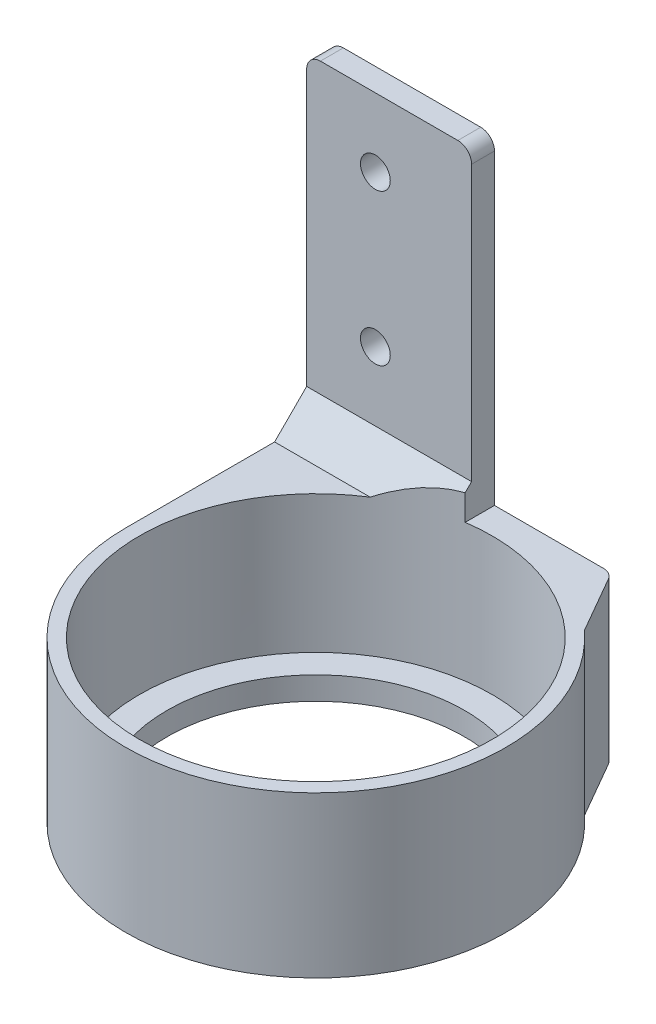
from build123d import *

# Parameters (mm, degrees)
SKIZZE1_R                       = 3.25
AUFSATZ_LINEAR_AUSTRAGEN1_DEPTH = 3
SKIZZE4_R                       = 41.5
AUFSATZ_LINEAR_AUSTRAGEN2_DEPTH = 35
SKIZZE6_R                       = 38.5
SCHNITT_LINEAR_AUSTRAGEN1_DEPTH = 160.091168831
LINEAR_AUSTRAGEN_D_NN1_START    = -30
SKIZZE7_R                       = 38.5
SKIZZE7_R_2                     = 32.5
LINEAR_AUSTRAGEN_D_NN1_DEPTH    = 5
SKIZZE16_W                      = 25.5
SKIZZE16_H                      = 35
AUFSATZ_LINEAR_AUSTRAGEN3_DEPTH = 3
AUFSATZ_LINEAR_AUSTRAGEN4_DEPTH = 35
AUFSATZ_LINEAR_AUSTRAGEN5_DEPTH = 35
SCHNITT_LINEAR_AUSTRAGEN3_DEPTH = 139.509927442
SKIZZE29_R                      = 3.25
AUFSATZ_LINEAR_AUSTRAGEN8_DEPTH = 2
AUFSATZ_LINEAR_AUSTRAGEN6_DEPTH = 36
SKIZZE31_R                      = 38.5
SCHNITT_LINEAR_AUSTRAGEN5_DEPTH = 10


with BuildPart() as part:
    # Skizze1 → Aufsatz-Linear austragen1 (new body)
    with BuildSketch(Plane.XY):
        with BuildLine():
            Line((3, 0), (33, 0))
            ThreePointArc((33, 0), (35.121320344, -0.878679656), (36, -3))
            Line((36, -3), (36, -97))
            Line((36, -97), (36, -105))
            Line((36, -105), (33, -105))
            Line((33, -105), (3, -105))
            Line((3, -105), (0, -105))
            Line((0, -105), (0, -97))
            Line((0, -97), (0, -3))
            ThreePointArc((0, -3), (0.878679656, -0.878679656), (3, 0))
        make_face()
        with Locations((15, -15)):
            Circle(SKIZZE1_R, mode=Mode.SUBTRACT)
        with Locations((15, -48)):
            Circle(SKIZZE1_R, mode=Mode.SUBTRACT)
    extrude(amount=AUFSATZ_LINEAR_AUSTRAGEN1_DEPTH)

    # Skizze16 → Aufsatz-Linear austragen3 (add)
    with BuildSketch(Plane(origin=(0, 0, 0), x_dir=(-1, 0, 0), z_dir=(0, 0, -1))):
        with Locations((-48.75, -87.5)):
            Rectangle(SKIZZE16_W, SKIZZE16_H)
    extrude(amount=-AUFSATZ_LINEAR_AUSTRAGEN3_DEPTH)



with BuildPart() as body_2:
    # Skizze4 → Aufsatz-Linear austragen2 (new body)
    with BuildSketch(Plane.XZ.offset(105)):
        with Locations(Location((41.5, 44.5, 0), (0, 0, 270))):
            Circle(SKIZZE4_R)
    extrude(amount=-AUFSATZ_LINEAR_AUSTRAGEN2_DEPTH)

    # Skizze6 → Schnitt-Linear austragen1 (cut, through all)
    with BuildSketch(Plane(origin=(0, -105, 0), x_dir=(-1, 0, 0), z_dir=(0, -1, 0))):
        with Locations(Location((-41.5, -44.5, 0), (0, 0, 90))):
            Circle(SKIZZE6_R)
    extrude(amount=-SCHNITT_LINEAR_AUSTRAGEN1_DEPTH, mode=Mode.SUBTRACT)

    # Skizze7 → Linear-Austragen-D_nn1 (add)
    with BuildSketch(Plane(origin=(0, -70, 0), x_dir=(1, 0, 0), z_dir=(0, 1, 0)).offset(LINEAR_AUSTRAGEN_D_NN1_START)):
        with Locations((41.5, -44.5)):
            Circle(SKIZZE7_R)
        with Locations((41.5, -44.5)):
            Circle(SKIZZE7_R_2, mode=Mode.SUBTRACT)
    extrude(amount=-LINEAR_AUSTRAGEN_D_NN1_DEPTH)


with BuildPart() as part_1:
    add(part.part)

    add(body_2.part)  # Aufsatz-Linear austragen4 merges body 2
    # Skizze17 → Aufsatz-Linear austragen4 (add)
    with BuildSketch(Plane.XZ.offset(105)):
        Polygon((69.453110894, 13.826337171), (65.463261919, 10.61767307), (61.157704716, 7.951065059), (56.456387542, 5.788806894), (51.630976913, 4.255580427), (46.581071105, 3.312226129), (41.5, 3), (61.5, 3), (61.5, 0), align=None)
    extrude(amount=-AUFSATZ_LINEAR_AUSTRAGEN4_DEPTH)

    # Skizze19 → Aufsatz-Linear austragen5 (add)
    with BuildSketch(Plane.XZ.offset(105)):
        Polygon((0, 44.5), (0.292769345, 39.579213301), (1.32012733, 34.115981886), (2.987465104, 29.039254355), (5.405172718, 24.020413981), (8.439906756, 19.41454137), (12.000641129, 15.310313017), (16.158896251, 11.635452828), (20.622161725, 8.634056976), (25.534528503, 6.193946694), (30.699904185, 4.429962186), (36.038410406, 3.360954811), (41.5, 3), (0, 3), align=None)
    extrude(amount=-AUFSATZ_LINEAR_AUSTRAGEN5_DEPTH)

    # Skizze21 → Schnitt-Linear austragen3 (cut, through all)
    with BuildSketch(Plane(origin=(0, -70, 0), x_dir=(1, 0, 0), z_dir=(0, 1, 0))):
        with BuildLine():
            Line((61.5, 0), (59.764741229, 0))
            ThreePointArc((59.764741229, 0), (61.266823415, -0.403127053), (62.365218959, -1.504167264))
            Line((62.365218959, -1.504167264), (61.5, 0))
        make_face()
    extrude(amount=-SCHNITT_LINEAR_AUSTRAGEN3_DEPTH, mode=Mode.SUBTRACT)

    # Skizze29 → Aufsatz-Linear austragen8 (add)
    with BuildSketch(Plane.XY.offset(3)):
        with BuildLine():
            Line((3, 0), (33, 0))
            ThreePointArc((33, 0), (35.121320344, -0.878679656), (36, -3))
            Line((36, -3), (36, -70))
            Line((36, -70), (0, -70))
            Line((0, -70), (0, -3))
            ThreePointArc((0, -3), (0.878679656, -0.878679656), (3, 0))
        make_face()
        with Locations((15, -15)):
            Circle(SKIZZE29_R, mode=Mode.SUBTRACT)
        with Locations((15, -48)):
            Circle(SKIZZE29_R, mode=Mode.SUBTRACT)
    extrude(amount=AUFSATZ_LINEAR_AUSTRAGEN8_DEPTH)

    # Skizze26 → Aufsatz-Linear austragen6 (add)
    with BuildSketch(Plane.ZY):
        Polygon((5, -70), (5, -63), (12, -70), align=None)
    extrude(amount=-AUFSATZ_LINEAR_AUSTRAGEN6_DEPTH)

    # Skizze31 → Schnitt-Linear austragen5 (cut)
    with BuildSketch(Plane(origin=(0, -70, 0), x_dir=(1, 0, 0), z_dir=(0, 1, 0))):
        with Locations(Location((41.5, -44.5, 0), (0, 0, 98.213210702))):
            Circle(SKIZZE31_R)
    extrude(amount=SCHNITT_LINEAR_AUSTRAGEN5_DEPTH, mode=Mode.SUBTRACT)


solid = part_1.part
